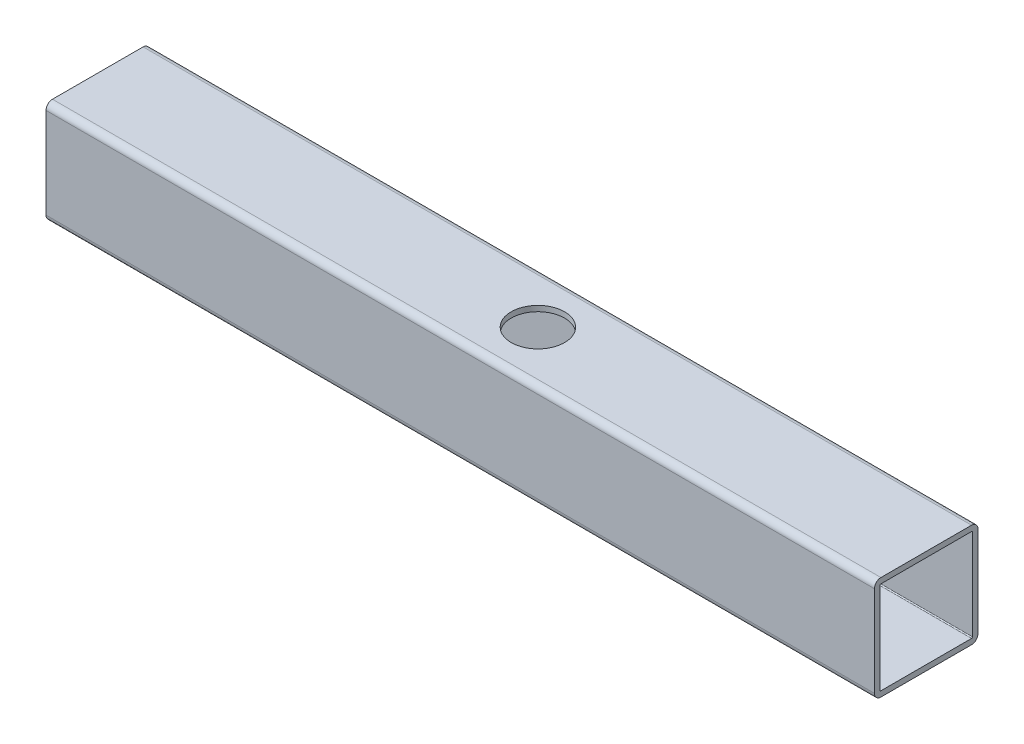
ISO-10303-21;
HEADER;
FILE_DESCRIPTION(('STEP AP214'),'2;1');
FILE_NAME('part.step','',(''),(''),'','','');
FILE_SCHEMA(('AUTOMOTIVE_DESIGN { 1 0 10303 214 1 1 1 1 }'));
ENDSEC;
DATA;
#1=APPLICATION_CONTEXT('core data for automotive mechanical design processes');
#2=APPLICATION_PROTOCOL_DEFINITION('international standard','automotive_design',2000,#1);
#3=PRODUCT_CONTEXT('',#1,'mechanical');
#4=PRODUCT('Part','Part','',(#3));
#5=PRODUCT_RELATED_PRODUCT_CATEGORY('part','',(#4));
#6=PRODUCT_DEFINITION_FORMATION('','',#4);
#7=PRODUCT_DEFINITION_CONTEXT('part definition',#1,'design');
#8=PRODUCT_DEFINITION('design','',#6,#7);
#9=PRODUCT_DEFINITION_SHAPE('','',#8);
#10=(LENGTH_UNIT() NAMED_UNIT(*) SI_UNIT(.MILLI.,.METRE.));
#11=(NAMED_UNIT(*) PLANE_ANGLE_UNIT() SI_UNIT($,.RADIAN.));
#12=(NAMED_UNIT(*) SI_UNIT($,.STERADIAN.) SOLID_ANGLE_UNIT());
#13=UNCERTAINTY_MEASURE_WITH_UNIT(LENGTH_MEASURE(1.E-05),#10,'distance_accuracy_value','');
#14=(GEOMETRIC_REPRESENTATION_CONTEXT(3) GLOBAL_UNCERTAINTY_ASSIGNED_CONTEXT((#13)) GLOBAL_UNIT_ASSIGNED_CONTEXT((#10,
#11,#12)) REPRESENTATION_CONTEXT('',''));
#15=CARTESIAN_POINT('',(0.,0.,0.));
#16=DIRECTION('',(0.,0.,1.));
#17=DIRECTION('',(1.,0.,0.));
#18=AXIS2_PLACEMENT_3D('',#15,#16,#17);
#19=CARTESIAN_POINT('',(203.2,3.65674086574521,-16.8519621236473));
#20=DIRECTION('',(-1.,0.,0.));
#21=DIRECTION('',(0.,0.,1.));
#22=AXIS2_PLACEMENT_3D('',#19,#20,#21);
#23=PLANE('',#22);
#24=CARTESIAN_POINT('',(203.2,3.65674086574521,-16.8519621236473));
#25=DIRECTION('',(1.,0.,0.));
#26=DIRECTION('',(0.,0.,1.));
#27=AXIS2_PLACEMENT_3D('',#24,#25,#26);
#28=CIRCLE('',#27,1.5875);
#29=CARTESIAN_POINT('',(203.2,3.6567408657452,-18.4394621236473));
#30=VERTEX_POINT('',#29);
#31=CARTESIAN_POINT('',(203.2,5.24424086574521,-16.8519621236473));
#32=VERTEX_POINT('',#31);
#33=EDGE_CURVE('E214',#30,#32,#28,.T.);
#34=ORIENTED_EDGE('',*,*,#33,.T.);
#35=DIRECTION('',(0.,0.,1.));
#36=VECTOR('',#35,1.);
#37=CARTESIAN_POINT('',(203.2,5.24424086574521,5.37303787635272));
#38=LINE('',#37,#36);
#39=CARTESIAN_POINT('',(203.2,5.24424086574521,5.37303787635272));
#40=VERTEX_POINT('',#39);
#41=EDGE_CURVE('E217',#32,#40,#38,.T.);
#42=ORIENTED_EDGE('',*,*,#41,.T.);
#43=CARTESIAN_POINT('',(203.2,3.65674086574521,5.37303787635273));
#44=DIRECTION('',(1.,0.,0.));
#45=DIRECTION('',(0.,0.,1.));
#46=AXIS2_PLACEMENT_3D('',#43,#44,#45);
#47=CIRCLE('',#46,1.5875);
#48=CARTESIAN_POINT('',(203.2,3.6567408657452,6.96053787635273));
#49=VERTEX_POINT('',#48);
#50=EDGE_CURVE('E220',#40,#49,#47,.T.);
#51=ORIENTED_EDGE('',*,*,#50,.T.);
#52=DIRECTION('',(0.,-1.,0.));
#53=VECTOR('',#52,1.);
#54=CARTESIAN_POINT('',(203.2,3.6567408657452,6.96053787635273));
#55=LINE('',#54,#53);
#56=CARTESIAN_POINT('',(203.2,-18.5682591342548,6.96053787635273));
#57=VERTEX_POINT('',#56);
#58=EDGE_CURVE('E222',#49,#57,#55,.T.);
#59=ORIENTED_EDGE('',*,*,#58,.T.);
#60=CARTESIAN_POINT('',(203.2,-18.5682591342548,5.37303787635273));
#61=DIRECTION('',(1.,0.,0.));
#62=DIRECTION('',(0.,0.,1.));
#63=AXIS2_PLACEMENT_3D('',#60,#61,#62);
#64=CIRCLE('',#63,1.5875);
#65=CARTESIAN_POINT('',(203.2,-20.1557591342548,5.37303787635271));
#66=VERTEX_POINT('',#65);
#67=EDGE_CURVE('E224',#57,#66,#64,.T.);
#68=ORIENTED_EDGE('',*,*,#67,.T.);
#69=DIRECTION('',(0.,0.,-1.));
#70=VECTOR('',#69,1.);
#71=CARTESIAN_POINT('',(203.2,-20.1557591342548,5.37303787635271));
#72=LINE('',#71,#70);
#73=CARTESIAN_POINT('',(203.2,-20.1557591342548,-16.8519621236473));
#74=VERTEX_POINT('',#73);
#75=EDGE_CURVE('E226',#66,#74,#72,.T.);
#76=ORIENTED_EDGE('',*,*,#75,.T.);
#77=CARTESIAN_POINT('',(203.2,-18.5682591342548,-16.8519621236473));
#78=DIRECTION('',(1.,0.,0.));
#79=DIRECTION('',(0.,0.,1.));
#80=AXIS2_PLACEMENT_3D('',#77,#78,#79);
#81=CIRCLE('',#80,1.5875);
#82=CARTESIAN_POINT('',(203.2,-18.5682591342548,-18.4394621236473));
#83=VERTEX_POINT('',#82);
#84=EDGE_CURVE('E228',#74,#83,#81,.T.);
#85=ORIENTED_EDGE('',*,*,#84,.T.);
#86=DIRECTION('',(0.,1.,0.));
#87=VECTOR('',#86,1.);
#88=CARTESIAN_POINT('',(203.2,3.6567408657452,-18.4394621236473));
#89=LINE('',#88,#87);
#90=EDGE_CURVE('E230',#83,#30,#89,.T.);
#91=ORIENTED_EDGE('',*,*,#90,.T.);
#92=EDGE_LOOP('',(#34,#42,#51,#59,#68,#76,#85,#91));
#93=FACE_BOUND('',#92,.T.);
#94=CARTESIAN_POINT('',(203.2,3.65674086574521,5.37303787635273));
#95=DIRECTION('',(1.,0.,0.));
#96=DIRECTION('',(0.,0.,1.));
#97=AXIS2_PLACEMENT_3D('',#94,#95,#96);
#98=CIRCLE('',#97,0.2413);
#99=CARTESIAN_POINT('',(203.2,3.89804086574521,5.37303787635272));
#100=VERTEX_POINT('',#99);
#101=CARTESIAN_POINT('',(203.2,3.6567408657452,5.61433787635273));
#102=VERTEX_POINT('',#101);
#103=EDGE_CURVE('E147',#100,#102,#98,.T.);
#104=ORIENTED_EDGE('',*,*,#103,.F.);
#105=DIRECTION('',(0.,0.,1.));
#106=VECTOR('',#105,1.);
#107=CARTESIAN_POINT('',(203.2,3.89804086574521,5.37303787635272));
#108=LINE('',#107,#106);
#109=CARTESIAN_POINT('',(203.2,3.89804086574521,-16.8519621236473));
#110=VERTEX_POINT('',#109);
#111=EDGE_CURVE('E181',#110,#100,#108,.T.);
#112=ORIENTED_EDGE('',*,*,#111,.F.);
#113=CARTESIAN_POINT('',(203.2,3.65674086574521,-16.8519621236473));
#114=DIRECTION('',(1.,0.,0.));
#115=DIRECTION('',(0.,0.,1.));
#116=AXIS2_PLACEMENT_3D('',#113,#114,#115);
#117=CIRCLE('',#116,0.2413);
#118=CARTESIAN_POINT('',(203.2,3.65674086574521,-17.0932621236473));
#119=VERTEX_POINT('',#118);
#120=EDGE_CURVE('E179',#119,#110,#117,.T.);
#121=ORIENTED_EDGE('',*,*,#120,.F.);
#122=DIRECTION('',(0.,1.,0.));
#123=VECTOR('',#122,1.);
#124=CARTESIAN_POINT('',(203.2,3.65674086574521,-17.0932621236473));
#125=LINE('',#124,#123);
#126=CARTESIAN_POINT('',(203.2,-18.5682591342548,-17.0932621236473));
#127=VERTEX_POINT('',#126);
#128=EDGE_CURVE('E177',#127,#119,#125,.T.);
#129=ORIENTED_EDGE('',*,*,#128,.F.);
#130=CARTESIAN_POINT('',(203.2,-18.5682591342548,-16.8519621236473));
#131=DIRECTION('',(1.,0.,0.));
#132=DIRECTION('',(0.,0.,1.));
#133=AXIS2_PLACEMENT_3D('',#130,#131,#132);
#134=CIRCLE('',#133,0.241299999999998);
#135=CARTESIAN_POINT('',(203.2,-18.8095591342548,-16.8519621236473));
#136=VERTEX_POINT('',#135);
#137=EDGE_CURVE('E175',#136,#127,#134,.T.);
#138=ORIENTED_EDGE('',*,*,#137,.F.);
#139=DIRECTION('',(0.,0.,-1.));
#140=VECTOR('',#139,1.);
#141=CARTESIAN_POINT('',(203.2,-18.8095591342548,5.37303787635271));
#142=LINE('',#141,#140);
#143=CARTESIAN_POINT('',(203.2,-18.8095591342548,5.37303787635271));
#144=VERTEX_POINT('',#143);
#145=EDGE_CURVE('E170',#144,#136,#142,.T.);
#146=ORIENTED_EDGE('',*,*,#145,.F.);
#147=CARTESIAN_POINT('',(203.2,-18.5682591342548,5.37303787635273));
#148=DIRECTION('',(1.,0.,0.));
#149=DIRECTION('',(0.,0.,1.));
#150=AXIS2_PLACEMENT_3D('',#147,#148,#149);
#151=CIRCLE('',#150,0.241299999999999);
#152=CARTESIAN_POINT('',(203.2,-18.5682591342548,5.61433787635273));
#153=VERTEX_POINT('',#152);
#154=EDGE_CURVE('E168',#153,#144,#151,.T.);
#155=ORIENTED_EDGE('',*,*,#154,.F.);
#156=DIRECTION('',(0.,-1.,0.));
#157=VECTOR('',#156,1.);
#158=CARTESIAN_POINT('',(203.2,3.6567408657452,5.61433787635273));
#159=LINE('',#158,#157);
#160=EDGE_CURVE('E155',#102,#153,#159,.T.);
#161=ORIENTED_EDGE('',*,*,#160,.F.);
#162=EDGE_LOOP('',(#104,#112,#121,#129,#138,#146,#155,#161));
#163=FACE_BOUND('',#162,.T.);
#164=ADVANCED_FACE('F33',(#93,#163),#23,.F.);
#165=CARTESIAN_POINT('',(0.,3.65674086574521,-16.8519621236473));
#166=DIRECTION('',(-1.,0.,0.));
#167=DIRECTION('',(0.,0.,1.));
#168=AXIS2_PLACEMENT_3D('',#165,#166,#167);
#169=PLANE('',#168);
#170=CARTESIAN_POINT('',(0.,3.65674086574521,-16.8519621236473));
#171=DIRECTION('',(1.,0.,0.));
#172=DIRECTION('',(0.,0.,1.));
#173=AXIS2_PLACEMENT_3D('',#170,#171,#172);
#174=CIRCLE('',#173,1.5875);
#175=CARTESIAN_POINT('',(0.,3.6567408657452,-18.4394621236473));
#176=VERTEX_POINT('',#175);
#177=CARTESIAN_POINT('',(0.,5.24424086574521,-16.8519621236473));
#178=VERTEX_POINT('',#177);
#179=EDGE_CURVE('E163',#176,#178,#174,.T.);
#180=ORIENTED_EDGE('',*,*,#179,.F.);
#181=DIRECTION('',(0.,1.,0.));
#182=VECTOR('',#181,1.);
#183=CARTESIAN_POINT('',(0.,3.6567408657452,-18.4394621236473));
#184=LINE('',#183,#182);
#185=CARTESIAN_POINT('',(0.,-18.5682591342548,-18.4394621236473));
#186=VERTEX_POINT('',#185);
#187=EDGE_CURVE('E218',#186,#176,#184,.T.);
#188=ORIENTED_EDGE('',*,*,#187,.F.);
#189=CARTESIAN_POINT('',(0.,-18.5682591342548,-16.8519621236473));
#190=DIRECTION('',(1.,0.,0.));
#191=DIRECTION('',(0.,0.,1.));
#192=AXIS2_PLACEMENT_3D('',#189,#190,#191);
#193=CIRCLE('',#192,1.5875);
#194=CARTESIAN_POINT('',(0.,-20.1557591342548,-16.8519621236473));
#195=VERTEX_POINT('',#194);
#196=EDGE_CURVE('E245',#195,#186,#193,.T.);
#197=ORIENTED_EDGE('',*,*,#196,.F.);
#198=DIRECTION('',(0.,0.,-1.));
#199=VECTOR('',#198,1.);
#200=CARTESIAN_POINT('',(0.,-20.1557591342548,5.37303787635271));
#201=LINE('',#200,#199);
#202=CARTESIAN_POINT('',(0.,-20.1557591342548,5.37303787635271));
#203=VERTEX_POINT('',#202);
#204=EDGE_CURVE('E243',#203,#195,#201,.T.);
#205=ORIENTED_EDGE('',*,*,#204,.F.);
#206=CARTESIAN_POINT('',(0.,-18.5682591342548,5.37303787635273));
#207=DIRECTION('',(1.,0.,0.));
#208=DIRECTION('',(0.,0.,1.));
#209=AXIS2_PLACEMENT_3D('',#206,#207,#208);
#210=CIRCLE('',#209,1.5875);
#211=CARTESIAN_POINT('',(0.,-18.5682591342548,6.96053787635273));
#212=VERTEX_POINT('',#211);
#213=EDGE_CURVE('E241',#212,#203,#210,.T.);
#214=ORIENTED_EDGE('',*,*,#213,.F.);
#215=DIRECTION('',(0.,-1.,0.));
#216=VECTOR('',#215,1.);
#217=CARTESIAN_POINT('',(0.,3.6567408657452,6.96053787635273));
#218=LINE('',#217,#216);
#219=CARTESIAN_POINT('',(0.,3.6567408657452,6.96053787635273));
#220=VERTEX_POINT('',#219);
#221=EDGE_CURVE('E239',#220,#212,#218,.T.);
#222=ORIENTED_EDGE('',*,*,#221,.F.);
#223=CARTESIAN_POINT('',(0.,3.65674086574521,5.37303787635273));
#224=DIRECTION('',(1.,0.,0.));
#225=DIRECTION('',(0.,0.,1.));
#226=AXIS2_PLACEMENT_3D('',#223,#224,#225);
#227=CIRCLE('',#226,1.5875);
#228=CARTESIAN_POINT('',(0.,5.24424086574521,5.37303787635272));
#229=VERTEX_POINT('',#228);
#230=EDGE_CURVE('E237',#229,#220,#227,.T.);
#231=ORIENTED_EDGE('',*,*,#230,.F.);
#232=DIRECTION('',(0.,0.,1.));
#233=VECTOR('',#232,1.);
#234=CARTESIAN_POINT('',(0.,5.24424086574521,5.37303787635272));
#235=LINE('',#234,#233);
#236=EDGE_CURVE('E235',#178,#229,#235,.T.);
#237=ORIENTED_EDGE('',*,*,#236,.F.);
#238=EDGE_LOOP('',(#180,#188,#197,#205,#214,#222,#231,#237));
#239=FACE_BOUND('',#238,.T.);
#240=DIRECTION('',(0.,0.,1.));
#241=VECTOR('',#240,1.);
#242=CARTESIAN_POINT('',(0.,3.89804086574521,5.37303787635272));
#243=LINE('',#242,#241);
#244=CARTESIAN_POINT('',(0.,3.89804086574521,-16.8519621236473));
#245=VERTEX_POINT('',#244);
#246=CARTESIAN_POINT('',(0.,3.89804086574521,5.37303787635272));
#247=VERTEX_POINT('',#246);
#248=EDGE_CURVE('E156',#245,#247,#243,.T.);
#249=ORIENTED_EDGE('',*,*,#248,.T.);
#250=CARTESIAN_POINT('',(0.,3.65674086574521,5.37303787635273));
#251=DIRECTION('',(1.,0.,0.));
#252=DIRECTION('',(0.,0.,1.));
#253=AXIS2_PLACEMENT_3D('',#250,#251,#252);
#254=CIRCLE('',#253,0.2413);
#255=CARTESIAN_POINT('',(0.,3.6567408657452,5.61433787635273));
#256=VERTEX_POINT('',#255);
#257=EDGE_CURVE('E57',#247,#256,#254,.T.);
#258=ORIENTED_EDGE('',*,*,#257,.T.);
#259=DIRECTION('',(0.,-1.,0.));
#260=VECTOR('',#259,1.);
#261=CARTESIAN_POINT('',(0.,3.6567408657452,5.61433787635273));
#262=LINE('',#261,#260);
#263=CARTESIAN_POINT('',(0.,-18.5682591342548,5.61433787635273));
#264=VERTEX_POINT('',#263);
#265=EDGE_CURVE('E162',#256,#264,#262,.T.);
#266=ORIENTED_EDGE('',*,*,#265,.T.);
#267=CARTESIAN_POINT('',(0.,-18.5682591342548,5.37303787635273));
#268=DIRECTION('',(1.,0.,0.));
#269=DIRECTION('',(0.,0.,1.));
#270=AXIS2_PLACEMENT_3D('',#267,#268,#269);
#271=CIRCLE('',#270,0.241299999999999);
#272=CARTESIAN_POINT('',(0.,-18.8095591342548,5.37303787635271));
#273=VERTEX_POINT('',#272);
#274=EDGE_CURVE('E186',#264,#273,#271,.T.);
#275=ORIENTED_EDGE('',*,*,#274,.T.);
#276=DIRECTION('',(0.,0.,-1.));
#277=VECTOR('',#276,1.);
#278=CARTESIAN_POINT('',(0.,-18.8095591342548,5.37303787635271));
#279=LINE('',#278,#277);
#280=CARTESIAN_POINT('',(0.,-18.8095591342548,-16.8519621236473));
#281=VERTEX_POINT('',#280);
#282=EDGE_CURVE('E189',#273,#281,#279,.T.);
#283=ORIENTED_EDGE('',*,*,#282,.T.);
#284=CARTESIAN_POINT('',(0.,-18.5682591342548,-16.8519621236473));
#285=DIRECTION('',(1.,0.,0.));
#286=DIRECTION('',(0.,0.,1.));
#287=AXIS2_PLACEMENT_3D('',#284,#285,#286);
#288=CIRCLE('',#287,0.241299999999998);
#289=CARTESIAN_POINT('',(0.,-18.5682591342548,-17.0932621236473));
#290=VERTEX_POINT('',#289);
#291=EDGE_CURVE('E192',#281,#290,#288,.T.);
#292=ORIENTED_EDGE('',*,*,#291,.T.);
#293=DIRECTION('',(0.,1.,0.));
#294=VECTOR('',#293,1.);
#295=CARTESIAN_POINT('',(0.,3.65674086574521,-17.0932621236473));
#296=LINE('',#295,#294);
#297=CARTESIAN_POINT('',(0.,3.65674086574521,-17.0932621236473));
#298=VERTEX_POINT('',#297);
#299=EDGE_CURVE('E195',#290,#298,#296,.T.);
#300=ORIENTED_EDGE('',*,*,#299,.T.);
#301=CARTESIAN_POINT('',(0.,3.65674086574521,-16.8519621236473));
#302=DIRECTION('',(1.,0.,0.));
#303=DIRECTION('',(0.,0.,1.));
#304=AXIS2_PLACEMENT_3D('',#301,#302,#303);
#305=CIRCLE('',#304,0.2413);
#306=EDGE_CURVE('E198',#298,#245,#305,.T.);
#307=ORIENTED_EDGE('',*,*,#306,.T.);
#308=EDGE_LOOP('',(#249,#258,#266,#275,#283,#292,#300,#307));
#309=FACE_BOUND('',#308,.T.);
#310=ADVANCED_FACE('F276',(#239,#309),#169,.T.);
#311=CARTESIAN_POINT('',(203.2,3.65674086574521,-16.8519621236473));
#312=DIRECTION('',(-1.,0.,0.));
#313=DIRECTION('',(0.,0.,1.));
#314=AXIS2_PLACEMENT_3D('',#311,#312,#313);
#315=CYLINDRICAL_SURFACE('',#314,1.5875);
#316=ORIENTED_EDGE('',*,*,#179,.T.);
#317=DIRECTION('',(-1.,0.,0.));
#318=VECTOR('',#317,1.);
#319=CARTESIAN_POINT('',(203.2,5.24424086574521,-16.8519621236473));
#320=LINE('',#319,#318);
#321=EDGE_CURVE('E11',#32,#178,#320,.T.);
#322=ORIENTED_EDGE('',*,*,#321,.F.);
#323=ORIENTED_EDGE('',*,*,#33,.F.);
#324=DIRECTION('',(-1.,0.,0.));
#325=VECTOR('',#324,1.);
#326=CARTESIAN_POINT('',(203.2,3.6567408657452,-18.4394621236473));
#327=LINE('',#326,#325);
#328=EDGE_CURVE('E232',#30,#176,#327,.T.);
#329=ORIENTED_EDGE('',*,*,#328,.T.);
#330=EDGE_LOOP('',(#316,#322,#323,#329));
#331=FACE_BOUND('',#330,.T.);
#332=ADVANCED_FACE('F35',(#331),#315,.T.);
#333=CARTESIAN_POINT('',(203.2,5.24424086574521,5.37303787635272));
#334=DIRECTION('',(0.,-1.,0.));
#335=DIRECTION('',(0.,0.,-1.));
#336=AXIS2_PLACEMENT_3D('',#333,#334,#335);
#337=PLANE('',#336);
#338=CARTESIAN_POINT('',(107.95,5.24424086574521,-5.73946212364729));
#339=DIRECTION('',(0.,-1.,0.));
#340=DIRECTION('',(0.,0.,-1.));
#341=AXIS2_PLACEMENT_3D('',#338,#339,#340);
#342=CIRCLE('',#341,6.5484375);
#343=CARTESIAN_POINT('',(107.95,5.24424086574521,-12.2878996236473));
#344=VERTEX_POINT('',#343);
#345=EDGE_CURVE('E373',#344,#344,#342,.T.);
#346=ORIENTED_EDGE('',*,*,#345,.T.);
#347=EDGE_LOOP('',(#346));
#348=FACE_BOUND('',#347,.T.);
#349=ORIENTED_EDGE('',*,*,#236,.T.);
#350=DIRECTION('',(-1.,0.,0.));
#351=VECTOR('',#350,1.);
#352=CARTESIAN_POINT('',(203.2,5.24424086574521,5.37303787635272));
#353=LINE('',#352,#351);
#354=EDGE_CURVE('E42',#40,#229,#353,.T.);
#355=ORIENTED_EDGE('',*,*,#354,.F.);
#356=ORIENTED_EDGE('',*,*,#41,.F.);
#357=ORIENTED_EDGE('',*,*,#321,.T.);
#358=EDGE_LOOP('',(#349,#355,#356,#357));
#359=FACE_BOUND('',#358,.T.);
#360=ADVANCED_FACE('F293',(#348,#359),#337,.F.);
#361=CARTESIAN_POINT('',(203.2,3.65674086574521,5.37303787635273));
#362=DIRECTION('',(-1.,0.,0.));
#363=DIRECTION('',(0.,0.,1.));
#364=AXIS2_PLACEMENT_3D('',#361,#362,#363);
#365=CYLINDRICAL_SURFACE('',#364,1.5875);
#366=ORIENTED_EDGE('',*,*,#230,.T.);
#367=DIRECTION('',(-1.,0.,0.));
#368=VECTOR('',#367,1.);
#369=CARTESIAN_POINT('',(203.2,3.6567408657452,6.96053787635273));
#370=LINE('',#369,#368);
#371=EDGE_CURVE('E262',#49,#220,#370,.T.);
#372=ORIENTED_EDGE('',*,*,#371,.F.);
#373=ORIENTED_EDGE('',*,*,#50,.F.);
#374=ORIENTED_EDGE('',*,*,#354,.T.);
#375=EDGE_LOOP('',(#366,#372,#373,#374));
#376=FACE_BOUND('',#375,.T.);
#377=ADVANCED_FACE('F270',(#376),#365,.T.);
#378=CARTESIAN_POINT('',(203.2,3.6567408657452,6.96053787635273));
#379=DIRECTION('',(0.,0.,-1.));
#380=DIRECTION('',(0.,1.,0.));
#381=AXIS2_PLACEMENT_3D('',#378,#379,#380);
#382=PLANE('',#381);
#383=ORIENTED_EDGE('',*,*,#221,.T.);
#384=DIRECTION('',(-1.,0.,0.));
#385=VECTOR('',#384,1.);
#386=CARTESIAN_POINT('',(203.2,-18.5682591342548,6.96053787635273));
#387=LINE('',#386,#385);
#388=EDGE_CURVE('E259',#57,#212,#387,.T.);
#389=ORIENTED_EDGE('',*,*,#388,.F.);
#390=ORIENTED_EDGE('',*,*,#58,.F.);
#391=ORIENTED_EDGE('',*,*,#371,.T.);
#392=EDGE_LOOP('',(#383,#389,#390,#391));
#393=FACE_BOUND('',#392,.T.);
#394=ADVANCED_FACE('F282',(#393),#382,.F.);
#395=CARTESIAN_POINT('',(203.2,-18.5682591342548,5.37303787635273));
#396=DIRECTION('',(-1.,0.,0.));
#397=DIRECTION('',(0.,0.,1.));
#398=AXIS2_PLACEMENT_3D('',#395,#396,#397);
#399=CYLINDRICAL_SURFACE('',#398,1.5875);
#400=ORIENTED_EDGE('',*,*,#213,.T.);
#401=DIRECTION('',(-1.,0.,0.));
#402=VECTOR('',#401,1.);
#403=CARTESIAN_POINT('',(203.2,-20.1557591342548,5.37303787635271));
#404=LINE('',#403,#402);
#405=EDGE_CURVE('E256',#66,#203,#404,.T.);
#406=ORIENTED_EDGE('',*,*,#405,.F.);
#407=ORIENTED_EDGE('',*,*,#67,.F.);
#408=ORIENTED_EDGE('',*,*,#388,.T.);
#409=EDGE_LOOP('',(#400,#406,#407,#408));
#410=FACE_BOUND('',#409,.T.);
#411=ADVANCED_FACE('F286',(#410),#399,.T.);
#412=CARTESIAN_POINT('',(203.2,-20.1557591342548,5.37303787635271));
#413=DIRECTION('',(0.,1.,0.));
#414=DIRECTION('',(0.,0.,1.));
#415=AXIS2_PLACEMENT_3D('',#412,#413,#414);
#416=PLANE('',#415);
#417=CARTESIAN_POINT('',(107.95,-20.1557591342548,-5.73946212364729));
#418=DIRECTION('',(0.,-1.,0.));
#419=DIRECTION('',(0.,0.,-1.));
#420=AXIS2_PLACEMENT_3D('',#417,#418,#419);
#421=CIRCLE('',#420,6.5484375);
#422=CARTESIAN_POINT('',(107.95,-20.1557591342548,-12.2878996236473));
#423=VERTEX_POINT('',#422);
#424=EDGE_CURVE('E375',#423,#423,#421,.T.);
#425=ORIENTED_EDGE('',*,*,#424,.F.);
#426=EDGE_LOOP('',(#425));
#427=FACE_BOUND('',#426,.T.);
#428=ORIENTED_EDGE('',*,*,#204,.T.);
#429=DIRECTION('',(-1.,0.,0.));
#430=VECTOR('',#429,1.);
#431=CARTESIAN_POINT('',(203.2,-20.1557591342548,-16.8519621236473));
#432=LINE('',#431,#430);
#433=EDGE_CURVE('E253',#74,#195,#432,.T.);
#434=ORIENTED_EDGE('',*,*,#433,.F.);
#435=ORIENTED_EDGE('',*,*,#75,.F.);
#436=ORIENTED_EDGE('',*,*,#405,.T.);
#437=EDGE_LOOP('',(#428,#434,#435,#436));
#438=FACE_BOUND('',#437,.T.);
#439=ADVANCED_FACE('F306',(#427,#438),#416,.F.);
#440=CARTESIAN_POINT('',(203.2,-18.5682591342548,-16.8519621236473));
#441=DIRECTION('',(-1.,0.,0.));
#442=DIRECTION('',(0.,0.,1.));
#443=AXIS2_PLACEMENT_3D('',#440,#441,#442);
#444=CYLINDRICAL_SURFACE('',#443,1.5875);
#445=ORIENTED_EDGE('',*,*,#196,.T.);
#446=DIRECTION('',(-1.,0.,0.));
#447=VECTOR('',#446,1.);
#448=CARTESIAN_POINT('',(203.2,-18.5682591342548,-18.4394621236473));
#449=LINE('',#448,#447);
#450=EDGE_CURVE('E250',#83,#186,#449,.T.);
#451=ORIENTED_EDGE('',*,*,#450,.F.);
#452=ORIENTED_EDGE('',*,*,#84,.F.);
#453=ORIENTED_EDGE('',*,*,#433,.T.);
#454=EDGE_LOOP('',(#445,#451,#452,#453));
#455=FACE_BOUND('',#454,.T.);
#456=ADVANCED_FACE('F304',(#455),#444,.T.);
#457=CARTESIAN_POINT('',(203.2,3.6567408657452,-18.4394621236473));
#458=DIRECTION('',(0.,0.,1.));
#459=DIRECTION('',(0.,-1.,0.));
#460=AXIS2_PLACEMENT_3D('',#457,#458,#459);
#461=PLANE('',#460);
#462=ORIENTED_EDGE('',*,*,#187,.T.);
#463=ORIENTED_EDGE('',*,*,#328,.F.);
#464=ORIENTED_EDGE('',*,*,#90,.F.);
#465=ORIENTED_EDGE('',*,*,#450,.T.);
#466=EDGE_LOOP('',(#462,#463,#464,#465));
#467=FACE_BOUND('',#466,.T.);
#468=ADVANCED_FACE('F299',(#467),#461,.F.);
#469=CARTESIAN_POINT('',(203.2,3.65674086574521,5.37303787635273));
#470=DIRECTION('',(-1.,0.,0.));
#471=DIRECTION('',(0.,0.,1.));
#472=AXIS2_PLACEMENT_3D('',#469,#470,#471);
#473=CYLINDRICAL_SURFACE('',#472,0.2413);
#474=ORIENTED_EDGE('',*,*,#257,.F.);
#475=DIRECTION('',(-1.,0.,0.));
#476=VECTOR('',#475,1.);
#477=CARTESIAN_POINT('',(203.2,3.89804086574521,5.37303787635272));
#478=LINE('',#477,#476);
#479=EDGE_CURVE('E151',#100,#247,#478,.T.);
#480=ORIENTED_EDGE('',*,*,#479,.F.);
#481=ORIENTED_EDGE('',*,*,#103,.T.);
#482=DIRECTION('',(-1.,0.,0.));
#483=VECTOR('',#482,1.);
#484=CARTESIAN_POINT('',(203.2,3.6567408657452,5.61433787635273));
#485=LINE('',#484,#483);
#486=EDGE_CURVE('E150',#102,#256,#485,.T.);
#487=ORIENTED_EDGE('',*,*,#486,.T.);
#488=EDGE_LOOP('',(#474,#480,#481,#487));
#489=FACE_BOUND('',#488,.T.);
#490=ADVANCED_FACE('F149',(#489),#473,.F.);
#491=CARTESIAN_POINT('',(203.2,3.6567408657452,5.61433787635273));
#492=DIRECTION('',(0.,0.,-1.));
#493=DIRECTION('',(0.,1.,0.));
#494=AXIS2_PLACEMENT_3D('',#491,#492,#493);
#495=PLANE('',#494);
#496=ORIENTED_EDGE('',*,*,#265,.F.);
#497=ORIENTED_EDGE('',*,*,#486,.F.);
#498=ORIENTED_EDGE('',*,*,#160,.T.);
#499=DIRECTION('',(-1.,0.,0.));
#500=VECTOR('',#499,1.);
#501=CARTESIAN_POINT('',(203.2,-18.5682591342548,5.61433787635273));
#502=LINE('',#501,#500);
#503=EDGE_CURVE('E164',#153,#264,#502,.T.);
#504=ORIENTED_EDGE('',*,*,#503,.T.);
#505=EDGE_LOOP('',(#496,#497,#498,#504));
#506=FACE_BOUND('',#505,.T.);
#507=ADVANCED_FACE('F159',(#506),#495,.T.);
#508=CARTESIAN_POINT('',(203.2,-18.5682591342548,5.37303787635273));
#509=DIRECTION('',(-1.,0.,0.));
#510=DIRECTION('',(0.,0.,1.));
#511=AXIS2_PLACEMENT_3D('',#508,#509,#510);
#512=CYLINDRICAL_SURFACE('',#511,0.241299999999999);
#513=ORIENTED_EDGE('',*,*,#274,.F.);
#514=ORIENTED_EDGE('',*,*,#503,.F.);
#515=ORIENTED_EDGE('',*,*,#154,.T.);
#516=DIRECTION('',(-1.,0.,0.));
#517=VECTOR('',#516,1.);
#518=CARTESIAN_POINT('',(203.2,-18.8095591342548,5.37303787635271));
#519=LINE('',#518,#517);
#520=EDGE_CURVE('E211',#144,#273,#519,.T.);
#521=ORIENTED_EDGE('',*,*,#520,.T.);
#522=EDGE_LOOP('',(#513,#514,#515,#521));
#523=FACE_BOUND('',#522,.T.);
#524=ADVANCED_FACE('F333',(#523),#512,.F.);
#525=CARTESIAN_POINT('',(203.2,-18.8095591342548,5.37303787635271));
#526=DIRECTION('',(0.,1.,0.));
#527=DIRECTION('',(0.,0.,1.));
#528=AXIS2_PLACEMENT_3D('',#525,#526,#527);
#529=PLANE('',#528);
#530=CARTESIAN_POINT('',(107.95,-18.8095591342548,-5.73946212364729));
#531=DIRECTION('',(0.,1.,0.));
#532=DIRECTION('',(0.,0.,1.));
#533=AXIS2_PLACEMENT_3D('',#530,#531,#532);
#534=CIRCLE('',#533,6.5484375);
#535=CARTESIAN_POINT('',(107.95,-18.8095591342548,0.808975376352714));
#536=VERTEX_POINT('',#535);
#537=EDGE_CURVE('E184',#536,#536,#534,.T.);
#538=ORIENTED_EDGE('',*,*,#537,.F.);
#539=EDGE_LOOP('',(#538));
#540=FACE_BOUND('',#539,.T.);
#541=ORIENTED_EDGE('',*,*,#282,.F.);
#542=ORIENTED_EDGE('',*,*,#520,.F.);
#543=ORIENTED_EDGE('',*,*,#145,.T.);
#544=DIRECTION('',(-1.,0.,0.));
#545=VECTOR('',#544,1.);
#546=CARTESIAN_POINT('',(203.2,-18.8095591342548,-16.8519621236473));
#547=LINE('',#546,#545);
#548=EDGE_CURVE('E209',#136,#281,#547,.T.);
#549=ORIENTED_EDGE('',*,*,#548,.T.);
#550=EDGE_LOOP('',(#541,#542,#543,#549));
#551=FACE_BOUND('',#550,.T.);
#552=ADVANCED_FACE('F337',(#540,#551),#529,.T.);
#553=CARTESIAN_POINT('',(203.2,-18.5682591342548,-16.8519621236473));
#554=DIRECTION('',(-1.,0.,0.));
#555=DIRECTION('',(0.,0.,1.));
#556=AXIS2_PLACEMENT_3D('',#553,#554,#555);
#557=CYLINDRICAL_SURFACE('',#556,0.241299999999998);
#558=ORIENTED_EDGE('',*,*,#291,.F.);
#559=ORIENTED_EDGE('',*,*,#548,.F.);
#560=ORIENTED_EDGE('',*,*,#137,.T.);
#561=DIRECTION('',(-1.,0.,0.));
#562=VECTOR('',#561,1.);
#563=CARTESIAN_POINT('',(203.2,-18.5682591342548,-17.0932621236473));
#564=LINE('',#563,#562);
#565=EDGE_CURVE('E207',#127,#290,#564,.T.);
#566=ORIENTED_EDGE('',*,*,#565,.T.);
#567=EDGE_LOOP('',(#558,#559,#560,#566));
#568=FACE_BOUND('',#567,.T.);
#569=ADVANCED_FACE('F343',(#568),#557,.F.);
#570=CARTESIAN_POINT('',(203.2,3.65674086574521,-17.0932621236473));
#571=DIRECTION('',(0.,0.,1.));
#572=DIRECTION('',(1.,0.,0.));
#573=AXIS2_PLACEMENT_3D('',#570,#571,#572);
#574=PLANE('',#573);
#575=ORIENTED_EDGE('',*,*,#299,.F.);
#576=ORIENTED_EDGE('',*,*,#565,.F.);
#577=ORIENTED_EDGE('',*,*,#128,.T.);
#578=DIRECTION('',(-1.,0.,0.));
#579=VECTOR('',#578,1.);
#580=CARTESIAN_POINT('',(203.2,3.65674086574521,-17.0932621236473));
#581=LINE('',#580,#579);
#582=EDGE_CURVE('E205',#119,#298,#581,.T.);
#583=ORIENTED_EDGE('',*,*,#582,.T.);
#584=EDGE_LOOP('',(#575,#576,#577,#583));
#585=FACE_BOUND('',#584,.T.);
#586=ADVANCED_FACE('F347',(#585),#574,.T.);
#587=CARTESIAN_POINT('',(203.2,3.65674086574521,-16.8519621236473));
#588=DIRECTION('',(-1.,0.,0.));
#589=DIRECTION('',(0.,0.,1.));
#590=AXIS2_PLACEMENT_3D('',#587,#588,#589);
#591=CYLINDRICAL_SURFACE('',#590,0.2413);
#592=ORIENTED_EDGE('',*,*,#306,.F.);
#593=ORIENTED_EDGE('',*,*,#582,.F.);
#594=ORIENTED_EDGE('',*,*,#120,.T.);
#595=DIRECTION('',(-1.,0.,0.));
#596=VECTOR('',#595,1.);
#597=CARTESIAN_POINT('',(203.2,3.89804086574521,-16.8519621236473));
#598=LINE('',#597,#596);
#599=EDGE_CURVE('E49',#110,#245,#598,.T.);
#600=ORIENTED_EDGE('',*,*,#599,.T.);
#601=EDGE_LOOP('',(#592,#593,#594,#600));
#602=FACE_BOUND('',#601,.T.);
#603=ADVANCED_FACE('F351',(#602),#591,.F.);
#604=CARTESIAN_POINT('',(203.2,3.89804086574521,5.37303787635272));
#605=DIRECTION('',(0.,-1.,0.));
#606=DIRECTION('',(0.,0.,-1.));
#607=AXIS2_PLACEMENT_3D('',#604,#605,#606);
#608=PLANE('',#607);
#609=CARTESIAN_POINT('',(107.95,3.89804086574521,-5.73946212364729));
#610=DIRECTION('',(0.,-1.,0.));
#611=DIRECTION('',(0.,0.,-1.));
#612=AXIS2_PLACEMENT_3D('',#609,#610,#611);
#613=CIRCLE('',#612,6.5484375);
#614=CARTESIAN_POINT('',(107.95,3.89804086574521,-12.2878996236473));
#615=VERTEX_POINT('',#614);
#616=EDGE_CURVE('E37',#615,#615,#613,.T.);
#617=ORIENTED_EDGE('',*,*,#616,.F.);
#618=EDGE_LOOP('',(#617));
#619=FACE_BOUND('',#618,.T.);
#620=ORIENTED_EDGE('',*,*,#248,.F.);
#621=ORIENTED_EDGE('',*,*,#599,.F.);
#622=ORIENTED_EDGE('',*,*,#111,.T.);
#623=ORIENTED_EDGE('',*,*,#479,.T.);
#624=EDGE_LOOP('',(#620,#621,#622,#623));
#625=FACE_BOUND('',#624,.T.);
#626=ADVANCED_FACE('F355',(#619,#625),#608,.T.);
#627=CARTESIAN_POINT('',(107.95,5.24424086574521,-5.73946212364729));
#628=DIRECTION('',(0.,-1.,0.));
#629=DIRECTION('',(0.,0.,-1.));
#630=AXIS2_PLACEMENT_3D('',#627,#628,#629);
#631=CYLINDRICAL_SURFACE('',#630,6.5484375);
#632=ORIENTED_EDGE('',*,*,#616,.T.);
#633=EDGE_LOOP('',(#632));
#634=FACE_BOUND('',#633,.T.);
#635=ORIENTED_EDGE('',*,*,#345,.F.);
#636=EDGE_LOOP('',(#635));
#637=FACE_BOUND('',#636,.T.);
#638=ADVANCED_FACE('F359',(#634,#637),#631,.F.);
#639=ORIENTED_EDGE('',*,*,#537,.T.);
#640=EDGE_LOOP('',(#639));
#641=FACE_BOUND('',#640,.T.);
#642=ORIENTED_EDGE('',*,*,#424,.T.);
#643=EDGE_LOOP('',(#642));
#644=FACE_BOUND('',#643,.T.);
#645=ADVANCED_FACE('F362',(#641,#644),#631,.F.);
#646=CLOSED_SHELL('',(#164,#310,#332,#360,#377,#394,#411,#439,#456,#468,#490,#507,#524,#552,
#569,#586,#603,#626,#638,#645));
#647=MANIFOLD_SOLID_BREP('B2',#646);
#648=ADVANCED_BREP_SHAPE_REPRESENTATION('',(#18,#647),#14);
#649=SHAPE_DEFINITION_REPRESENTATION(#9,#648);
ENDSEC;
END-ISO-10303-21;
